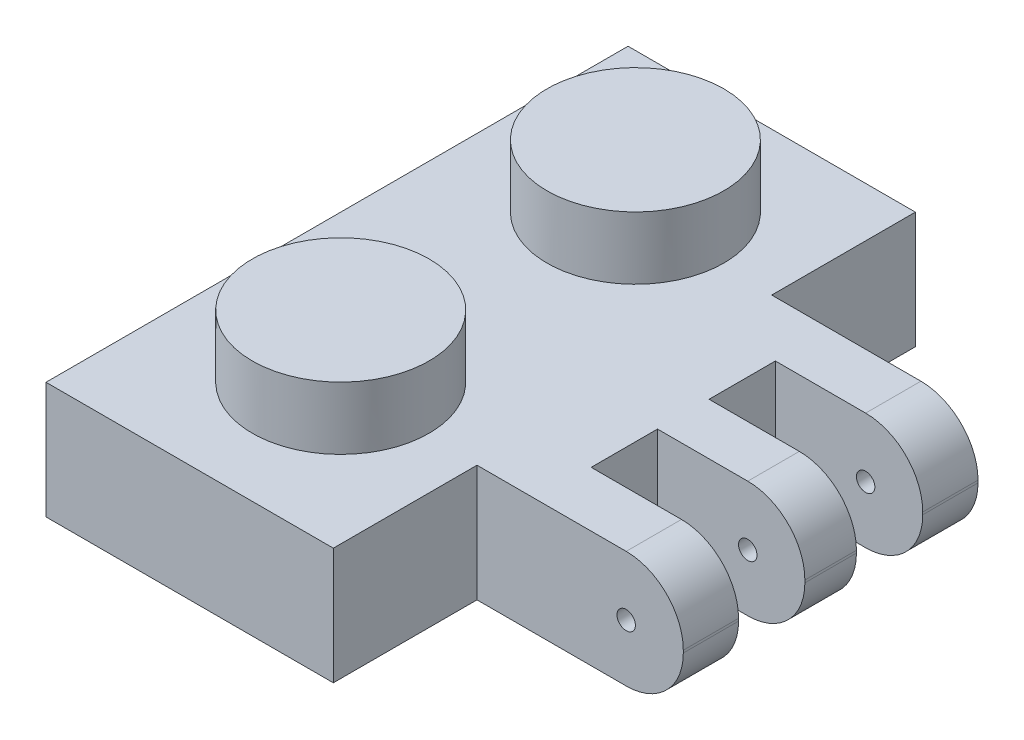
from build123d import *

# Parameters (mm, degrees)
SKETCH1_W           = 7.8
SKETCH1_H           = 15.8
EXTRUDE1_DEPTH      = 3.166
SKETCH2_R           = 2.4
EXTRUDE2_DEPTH      = 1.7
SKETCH3_W           = 4.9
SKETCH3_H           = 4.9
EXTRUDE3_DEPTH      = 2.5
LPATTERN1_COUNT     = 2
LPATTERN1_PITCH     = 8
LPATTERN2_COUNT     = 2
LPATTERN2_PITCH     = 8
SKETCH5_W           = 8
SKETCH5_H           = 3.166
BOSS_EXTRUDE1_DEPTH = 5.6
SKETCH6_W           = 1.8
SKETCH6_H           = 3.166
CUT_EXTRUDE1_DEPTH  = 4
SKETCH7_W           = 4
SKETCH7_H           = 1.8
CUT_EXTRUDE2_DEPTH  = 21.957661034
FILLET1_R           = 1.55
SKETCH8_R           = 0.25
CUT_EXTRUDE3_DEPTH  = 19.570082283


with BuildPart() as part:
    # Sketch1 → Extrude1 (new body)
    with BuildSketch(Plane(origin=(0, 0, 0), x_dir=(1, 0, 0), z_dir=(0, 1, 0))):
        with Locations((3.9, 7.9)):
            Rectangle(SKETCH1_W, SKETCH1_H)
    extrude(amount=EXTRUDE1_DEPTH)

    # Sketch2 → Extrude2 (add)
    with BuildSketch(Plane(origin=(0, 3.166, 0), x_dir=(1, 0, 0), z_dir=(0, 1, 0))):
        with Locations(Location((4, 4, 0), (0, 0, 90))):
            Circle(SKETCH2_R)
    extrude2 = extrude(amount=EXTRUDE2_DEPTH)

    # Sketch3 → Extrude3 (cut)
    with BuildSketch(Plane.XZ):
        with Locations((3.9, -11.9)):
            Rectangle(SKETCH3_W, SKETCH3_H)
    extrude3 = extrude(amount=-EXTRUDE3_DEPTH, mode=Mode.SUBTRACT)

    # LPattern1: Extrude2 ×2
    with Locations(*[(0, 0, -i * LPATTERN1_PITCH) for i in range(1, LPATTERN1_COUNT)]):
        add(extrude2)

    # LPattern2: Extrude3 ×2
    with Locations(*[(0, 0, i * LPATTERN2_PITCH) for i in range(1, LPATTERN2_COUNT)]):
        add(extrude3, mode=Mode.SUBTRACT)

    # Sketch5 → Boss-Extrude1 (add)
    with BuildSketch(Plane(origin=(7.8, 0, 0), x_dir=(0, 0, -1), z_dir=(1, 0, 0))):
        with Locations((7.9, 1.583)):
            Rectangle(SKETCH5_W, SKETCH5_H)
    extrude(amount=BOSS_EXTRUDE1_DEPTH)

    # Sketch6 → Cut-Extrude1 (cut)
    with BuildSketch(Plane(origin=(13.4, 0, 0), x_dir=(0, 0, -1), z_dir=(1, 0, 0))):
        with Locations((9.5, 1.583)):
            Rectangle(SKETCH6_W, SKETCH6_H)
    extrude(amount=-CUT_EXTRUDE1_DEPTH, mode=Mode.SUBTRACT)

    # Sketch7 → Cut-Extrude2 (cut, through all)
    with BuildSketch(Plane(origin=(0, 3.166, 0), x_dir=(1, 0, 0), z_dir=(0, 1, 0))):
        with Locations((11.4, 6.3)):
            Rectangle(SKETCH7_W, SKETCH7_H)
    extrude(amount=-CUT_EXTRUDE2_DEPTH, mode=Mode.SUBTRACT)

    # Fillet1
    fillet1_edges = [part.edges().sort_by_distance(p)[0] for p in [
        (13.4, 0, -11.15),
        (13.4, 3.166, -11.15),
        (13.4, 0, -7.9),
        (13.4, 3.166, -7.9),
        (13.4, 0, -4.65),
        (13.4, 3.166, -4.65),
    ]]
    fillet(fillet1_edges, radius=FILLET1_R)

    # Sketch8 → Cut-Extrude3 (cut, through all)
    with BuildSketch(Plane.XY.offset(-3.9)):
        with Locations((11.85, 1.55)):
            Circle(SKETCH8_R)
    extrude(amount=-CUT_EXTRUDE3_DEPTH, mode=Mode.SUBTRACT)


solid = part.part
